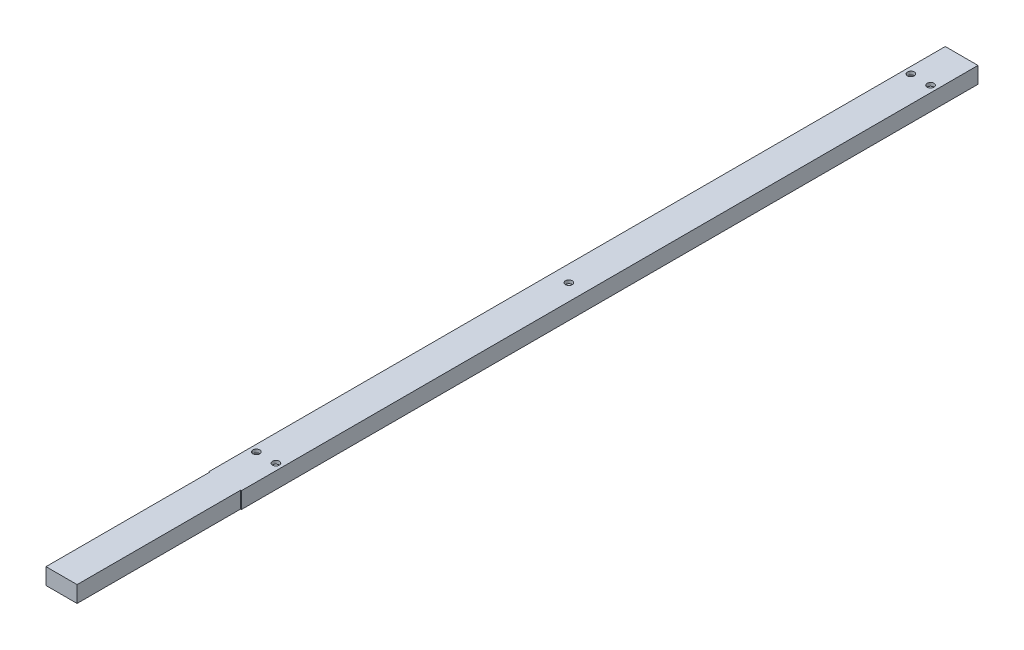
from build123d import *

# Parameters (mm, degrees)
SKETCH_1_W              = 20
SKETCH_1_H              = 10
SKETCH_1_W_2            = 16
SKETCH_1_H_2            = 6
EXTRUDE_1_DEPTH         = 450
HOLE_WIZARD_4_2_4_2_1_D = 4.2
HOLE_WIZARD_4_2_4_2_2_D = 4.2
SKETCH_8_W              = 19
SKETCH_8_H              = 10
EXTRUDE_2_DEPTH         = 100


with BuildPart() as part:
    # Sketch 1 → Extrude 1 (new body)
    with BuildSketch(Plane.XY):
        Rectangle(SKETCH_1_W, SKETCH_1_H)
        Rectangle(SKETCH_1_W_2, SKETCH_1_H_2, mode=Mode.SUBTRACT)
    extrude(amount=EXTRUDE_1_DEPTH)

    # Hole Wizard 4.2 _4.2_ _1 (through all)
    with Locations(Plane(origin=(0, 5, 0), x_dir=(1, 0, 0), z_dir=(0, 1, 0))):
        with Locations((-6, -425), (6, -425), (-6, -25), (6, -25)):
            Hole(HOLE_WIZARD_4_2_4_2_1_D / 2)

    # Hole Wizard 4.2 _4.2_ _2 (through all)
    with Locations(Plane(origin=(0, -5, 0), x_dir=(-1, 0, 0), z_dir=(0, -1, 0))):
        with Locations((0, -240)):
            Hole(HOLE_WIZARD_4_2_4_2_2_D / 2)

    # Sketch 8 → Extrude 2 (add)
    with BuildSketch(Plane(origin=(0, 0, 450), x_dir=(-1, 0, 0), z_dir=(0, 0, -1))):
        Rectangle(SKETCH_8_W, SKETCH_8_H)
    extrude(amount=-EXTRUDE_2_DEPTH)


solid = part.part
